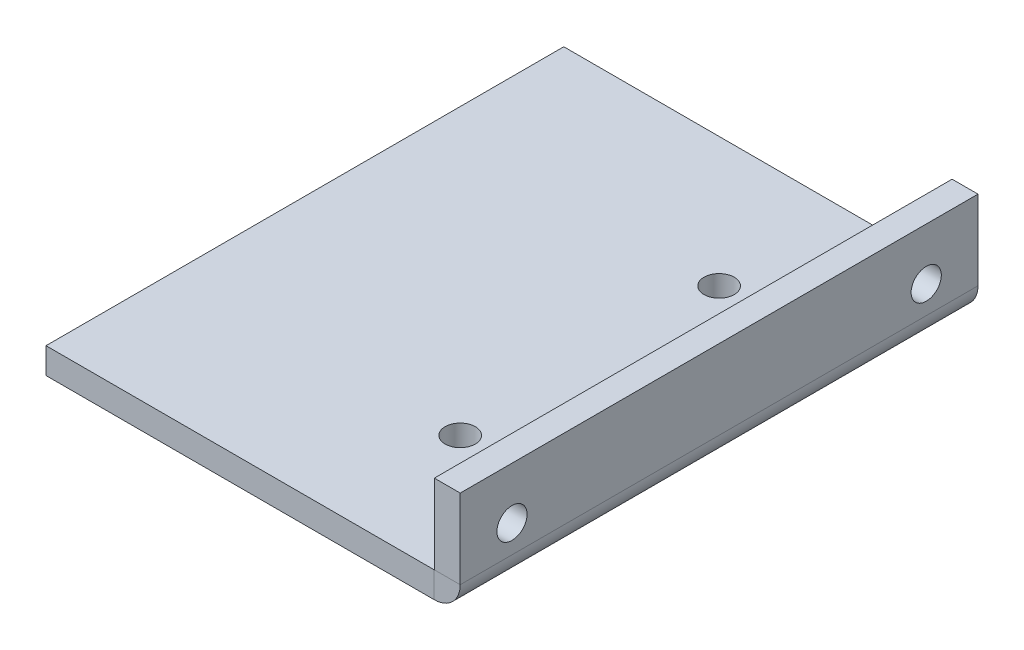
ISO-10303-21;
HEADER;
FILE_DESCRIPTION(('STEP AP214'),'2;1');
FILE_NAME('part.step','',(''),(''),'','','');
FILE_SCHEMA(('AUTOMOTIVE_DESIGN { 1 0 10303 214 1 1 1 1 }'));
ENDSEC;
DATA;
#1=APPLICATION_CONTEXT('core data for automotive mechanical design processes');
#2=APPLICATION_PROTOCOL_DEFINITION('international standard','automotive_design',2000,#1);
#3=PRODUCT_CONTEXT('',#1,'mechanical');
#4=PRODUCT('Part','Part','',(#3));
#5=PRODUCT_RELATED_PRODUCT_CATEGORY('part','',(#4));
#6=PRODUCT_DEFINITION_FORMATION('','',#4);
#7=PRODUCT_DEFINITION_CONTEXT('part definition',#1,'design');
#8=PRODUCT_DEFINITION('design','',#6,#7);
#9=PRODUCT_DEFINITION_SHAPE('','',#8);
#10=(LENGTH_UNIT() NAMED_UNIT(*) SI_UNIT(.MILLI.,.METRE.));
#11=(NAMED_UNIT(*) PLANE_ANGLE_UNIT() SI_UNIT($,.RADIAN.));
#12=(NAMED_UNIT(*) SI_UNIT($,.STERADIAN.) SOLID_ANGLE_UNIT());
#13=UNCERTAINTY_MEASURE_WITH_UNIT(LENGTH_MEASURE(1.E-05),#10,'distance_accuracy_value','');
#14=(GEOMETRIC_REPRESENTATION_CONTEXT(3) GLOBAL_UNCERTAINTY_ASSIGNED_CONTEXT((#13)) GLOBAL_UNIT_ASSIGNED_CONTEXT((#10,
#11,#12)) REPRESENTATION_CONTEXT('',''));
#15=CARTESIAN_POINT('',(0.,0.,0.));
#16=DIRECTION('',(0.,0.,1.));
#17=DIRECTION('',(1.,0.,0.));
#18=AXIS2_PLACEMENT_3D('',#15,#16,#17);
#19=CARTESIAN_POINT('',(45.0000000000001,-44.7901546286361,-60.));
#20=DIRECTION('',(1.,0.,0.));
#21=DIRECTION('',(0.,0.,-1.));
#22=AXIS2_PLACEMENT_3D('',#19,#20,#21);
#23=PLANE('',#22);
#24=CARTESIAN_POINT('',(45.,6.20984537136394,-54.));
#25=DIRECTION('',(-1.,0.,0.));
#26=DIRECTION('',(0.,0.,1.));
#27=AXIS2_PLACEMENT_3D('',#24,#25,#26);
#28=CIRCLE('',#27,1.75);
#29=CARTESIAN_POINT('',(45.,6.20984537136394,-52.25));
#30=VERTEX_POINT('',#29);
#31=EDGE_CURVE('E147',#30,#30,#28,.T.);
#32=ORIENTED_EDGE('',*,*,#31,.F.);
#33=EDGE_LOOP('',(#32));
#34=FACE_BOUND('',#33,.T.);
#35=CARTESIAN_POINT('',(45.,6.20984537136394,-6.));
#36=DIRECTION('',(-1.,0.,0.));
#37=DIRECTION('',(0.,0.,1.));
#38=AXIS2_PLACEMENT_3D('',#35,#36,#37);
#39=CIRCLE('',#38,1.75);
#40=CARTESIAN_POINT('',(45.,6.20984537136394,-4.25));
#41=VERTEX_POINT('',#40);
#42=EDGE_CURVE('E412',#41,#41,#39,.T.);
#43=ORIENTED_EDGE('',*,*,#42,.F.);
#44=EDGE_LOOP('',(#43));
#45=FACE_BOUND('',#44,.T.);
#46=DIRECTION('',(0.,-1.,0.));
#47=VECTOR('',#46,1.);
#48=CARTESIAN_POINT('',(45.0000000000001,-44.7901546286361,-60.));
#49=LINE('',#48,#47);
#50=CARTESIAN_POINT('',(45.,12.2098453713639,-60.));
#51=VERTEX_POINT('',#50);
#52=CARTESIAN_POINT('',(45.0000000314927,3.01,-60.));
#53=VERTEX_POINT('',#52);
#54=EDGE_CURVE('E42',#51,#53,#49,.T.);
#55=ORIENTED_EDGE('',*,*,#54,.T.);
#56=DIRECTION('',(0.,0.,1.));
#57=VECTOR('',#56,1.);
#58=CARTESIAN_POINT('',(45.,3.01000000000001,-60.));
#59=LINE('',#58,#57);
#60=CARTESIAN_POINT('',(45.,3.01,0.));
#61=VERTEX_POINT('',#60);
#62=EDGE_CURVE('E118',#53,#61,#59,.T.);
#63=ORIENTED_EDGE('',*,*,#62,.T.);
#64=DIRECTION('',(0.,1.,0.));
#65=VECTOR('',#64,1.);
#66=CARTESIAN_POINT('',(45.0000000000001,-44.7901546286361,0.));
#67=LINE('',#66,#65);
#68=CARTESIAN_POINT('',(45.,12.2098453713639,0.));
#69=VERTEX_POINT('',#68);
#70=EDGE_CURVE('E137',#61,#69,#67,.T.);
#71=ORIENTED_EDGE('',*,*,#70,.T.);
#72=DIRECTION('',(0.,0.,-1.));
#73=VECTOR('',#72,1.);
#74=CARTESIAN_POINT('',(45.,12.2098453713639,0.));
#75=LINE('',#74,#73);
#76=EDGE_CURVE('E63',#69,#51,#75,.T.);
#77=ORIENTED_EDGE('',*,*,#76,.T.);
#78=EDGE_LOOP('',(#55,#63,#71,#77));
#79=FACE_BOUND('',#78,.T.);
#80=ADVANCED_FACE('F38',(#34,#45,#79),#23,.F.);
#81=CARTESIAN_POINT('',(45.0000000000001,-44.7901546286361,0.));
#82=DIRECTION('',(0.,0.,-1.));
#83=DIRECTION('',(0.,-1.,0.));
#84=AXIS2_PLACEMENT_3D('',#81,#82,#83);
#85=PLANE('',#84);
#86=ORIENTED_EDGE('',*,*,#70,.F.);
#87=DIRECTION('',(1.,0.,0.));
#88=VECTOR('',#87,1.);
#89=CARTESIAN_POINT('',(45.,3.01000000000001,0.));
#90=LINE('',#89,#88);
#91=CARTESIAN_POINT('',(48.0000000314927,3.01,0.));
#92=VERTEX_POINT('',#91);
#93=EDGE_CURVE('E12',#61,#92,#90,.T.);
#94=ORIENTED_EDGE('',*,*,#93,.T.);
#95=DIRECTION('',(0.,1.,0.));
#96=VECTOR('',#95,1.);
#97=CARTESIAN_POINT('',(48.0000000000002,-44.790154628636,0.));
#98=LINE('',#97,#96);
#99=CARTESIAN_POINT('',(48.,12.209845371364,0.));
#100=VERTEX_POINT('',#99);
#101=EDGE_CURVE('E143',#92,#100,#98,.T.);
#102=ORIENTED_EDGE('',*,*,#101,.T.);
#103=DIRECTION('',(1.,0.,0.));
#104=VECTOR('',#103,1.);
#105=CARTESIAN_POINT('',(45.,12.2098453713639,0.));
#106=LINE('',#105,#104);
#107=EDGE_CURVE('E156',#69,#100,#106,.T.);
#108=ORIENTED_EDGE('',*,*,#107,.F.);
#109=EDGE_LOOP('',(#86,#94,#102,#108));
#110=FACE_BOUND('',#109,.T.);
#111=ADVANCED_FACE('F40',(#110),#85,.F.);
#112=CARTESIAN_POINT('',(45.0000000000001,-44.7901546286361,-60.));
#113=DIRECTION('',(0.,0.,1.));
#114=DIRECTION('',(0.,1.,0.));
#115=AXIS2_PLACEMENT_3D('',#112,#113,#114);
#116=PLANE('',#115);
#117=DIRECTION('',(0.,-1.,0.));
#118=VECTOR('',#117,1.);
#119=CARTESIAN_POINT('',(48.0000000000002,-44.790154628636,-60.));
#120=LINE('',#119,#118);
#121=CARTESIAN_POINT('',(48.,12.209845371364,-60.));
#122=VERTEX_POINT('',#121);
#123=CARTESIAN_POINT('',(48.0000000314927,3.01,-60.));
#124=VERTEX_POINT('',#123);
#125=EDGE_CURVE('E132',#122,#124,#120,.T.);
#126=ORIENTED_EDGE('',*,*,#125,.T.);
#127=DIRECTION('',(-1.,0.,0.));
#128=VECTOR('',#127,1.);
#129=CARTESIAN_POINT('',(45.,3.01000000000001,-60.));
#130=LINE('',#129,#128);
#131=EDGE_CURVE('E108',#124,#53,#130,.T.);
#132=ORIENTED_EDGE('',*,*,#131,.T.);
#133=ORIENTED_EDGE('',*,*,#54,.F.);
#134=DIRECTION('',(1.,0.,0.));
#135=VECTOR('',#134,1.);
#136=CARTESIAN_POINT('',(45.,12.2098453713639,-60.));
#137=LINE('',#136,#135);
#138=EDGE_CURVE('E134',#51,#122,#137,.T.);
#139=ORIENTED_EDGE('',*,*,#138,.T.);
#140=EDGE_LOOP('',(#126,#132,#133,#139));
#141=FACE_BOUND('',#140,.T.);
#142=ADVANCED_FACE('F133',(#141),#116,.F.);
#143=CARTESIAN_POINT('',(48.0000000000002,-44.790154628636,-60.));
#144=DIRECTION('',(1.,0.,0.));
#145=DIRECTION('',(0.,0.,-1.));
#146=AXIS2_PLACEMENT_3D('',#143,#144,#145);
#147=PLANE('',#146);
#148=DIRECTION('',(0.,0.,1.));
#149=VECTOR('',#148,1.);
#150=CARTESIAN_POINT('',(48.,3.01000000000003,-60.));
#151=LINE('',#150,#149);
#152=EDGE_CURVE('E47',#124,#92,#151,.T.);
#153=ORIENTED_EDGE('',*,*,#152,.F.);
#154=ORIENTED_EDGE('',*,*,#125,.F.);
#155=DIRECTION('',(0.,0.,-1.));
#156=VECTOR('',#155,1.);
#157=CARTESIAN_POINT('',(48.,12.209845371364,0.));
#158=LINE('',#157,#156);
#159=EDGE_CURVE('E138',#100,#122,#158,.T.);
#160=ORIENTED_EDGE('',*,*,#159,.F.);
#161=ORIENTED_EDGE('',*,*,#101,.F.);
#162=EDGE_LOOP('',(#153,#154,#160,#161));
#163=FACE_BOUND('',#162,.T.);
#164=CARTESIAN_POINT('',(48.,6.20984537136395,-54.));
#165=DIRECTION('',(-1.,0.,0.));
#166=DIRECTION('',(0.,0.,1.));
#167=AXIS2_PLACEMENT_3D('',#164,#165,#166);
#168=CIRCLE('',#167,1.75);
#169=CARTESIAN_POINT('',(48.,6.20984537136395,-52.25));
#170=VERTEX_POINT('',#169);
#171=EDGE_CURVE('E415',#170,#170,#168,.T.);
#172=ORIENTED_EDGE('',*,*,#171,.T.);
#173=EDGE_LOOP('',(#172));
#174=FACE_BOUND('',#173,.T.);
#175=CARTESIAN_POINT('',(48.,6.20984537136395,-6.));
#176=DIRECTION('',(-1.,0.,0.));
#177=DIRECTION('',(0.,0.,1.));
#178=AXIS2_PLACEMENT_3D('',#175,#176,#177);
#179=CIRCLE('',#178,1.75);
#180=CARTESIAN_POINT('',(48.,6.20984537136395,-4.25));
#181=VERTEX_POINT('',#180);
#182=EDGE_CURVE('E375',#181,#181,#179,.T.);
#183=ORIENTED_EDGE('',*,*,#182,.T.);
#184=EDGE_LOOP('',(#183));
#185=FACE_BOUND('',#184,.T.);
#186=ADVANCED_FACE('F141',(#163,#174,#185),#147,.T.);
#187=CARTESIAN_POINT('',(45.,12.2098453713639,0.));
#188=DIRECTION('',(0.,-1.,0.));
#189=DIRECTION('',(0.,0.,1.));
#190=AXIS2_PLACEMENT_3D('',#187,#188,#189);
#191=PLANE('',#190);
#192=ORIENTED_EDGE('',*,*,#159,.T.);
#193=ORIENTED_EDGE('',*,*,#138,.F.);
#194=ORIENTED_EDGE('',*,*,#76,.F.);
#195=ORIENTED_EDGE('',*,*,#107,.T.);
#196=EDGE_LOOP('',(#192,#193,#194,#195));
#197=FACE_BOUND('',#196,.T.);
#198=ADVANCED_FACE('F160',(#197),#191,.F.);
#199=CARTESIAN_POINT('',(45.,6.20984537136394,-54.));
#200=DIRECTION('',(1.,0.,0.));
#201=DIRECTION('',(0.,0.,-1.));
#202=AXIS2_PLACEMENT_3D('',#199,#200,#201);
#203=CYLINDRICAL_SURFACE('',#202,1.75);
#204=ORIENTED_EDGE('',*,*,#31,.T.);
#205=EDGE_LOOP('',(#204));
#206=FACE_BOUND('',#205,.T.);
#207=ORIENTED_EDGE('',*,*,#171,.F.);
#208=EDGE_LOOP('',(#207));
#209=FACE_BOUND('',#208,.T.);
#210=ADVANCED_FACE('F162',(#206,#209),#203,.F.);
#211=CARTESIAN_POINT('',(45.,6.20984537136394,-6.));
#212=DIRECTION('',(1.,0.,0.));
#213=DIRECTION('',(0.,0.,-1.));
#214=AXIS2_PLACEMENT_3D('',#211,#212,#213);
#215=CYLINDRICAL_SURFACE('',#214,1.75);
#216=ORIENTED_EDGE('',*,*,#42,.T.);
#217=EDGE_LOOP('',(#216));
#218=FACE_BOUND('',#217,.T.);
#219=ORIENTED_EDGE('',*,*,#182,.F.);
#220=EDGE_LOOP('',(#219));
#221=FACE_BOUND('',#220,.T.);
#222=ADVANCED_FACE('F168',(#218,#221),#215,.F.);
#223=CARTESIAN_POINT('',(33.,3.,-15.));
#224=DIRECTION('',(0.,-1.,0.));
#225=DIRECTION('',(0.,0.,-1.));
#226=AXIS2_PLACEMENT_3D('',#223,#224,#225);
#227=CYLINDRICAL_SURFACE('',#226,1.75);
#228=CARTESIAN_POINT('',(33.,3.,-15.));
#229=DIRECTION('',(0.,1.,0.));
#230=DIRECTION('',(0.,0.,1.));
#231=AXIS2_PLACEMENT_3D('',#228,#229,#230);
#232=CIRCLE('',#231,1.75);
#233=CARTESIAN_POINT('',(33.,3.,-13.25));
#234=VERTEX_POINT('',#233);
#235=EDGE_CURVE('E404',#234,#234,#232,.T.);
#236=ORIENTED_EDGE('',*,*,#235,.T.);
#237=EDGE_LOOP('',(#236));
#238=FACE_BOUND('',#237,.T.);
#239=CARTESIAN_POINT('',(33.,0.,-15.));
#240=DIRECTION('',(0.,1.,0.));
#241=DIRECTION('',(0.,0.,1.));
#242=AXIS2_PLACEMENT_3D('',#239,#240,#241);
#243=CIRCLE('',#242,1.75);
#244=CARTESIAN_POINT('',(33.,0.,-13.25));
#245=VERTEX_POINT('',#244);
#246=EDGE_CURVE('E383',#245,#245,#243,.T.);
#247=ORIENTED_EDGE('',*,*,#246,.F.);
#248=EDGE_LOOP('',(#247));
#249=FACE_BOUND('',#248,.T.);
#250=ADVANCED_FACE('F213',(#238,#249),#227,.F.);
#251=CARTESIAN_POINT('',(33.,3.,-45.));
#252=DIRECTION('',(0.,-1.,0.));
#253=DIRECTION('',(0.,0.,-1.));
#254=AXIS2_PLACEMENT_3D('',#251,#252,#253);
#255=CYLINDRICAL_SURFACE('',#254,1.75);
#256=CARTESIAN_POINT('',(33.,3.,-45.));
#257=DIRECTION('',(0.,1.,0.));
#258=DIRECTION('',(0.,0.,1.));
#259=AXIS2_PLACEMENT_3D('',#256,#257,#258);
#260=CIRCLE('',#259,1.75);
#261=CARTESIAN_POINT('',(33.,3.,-43.25));
#262=VERTEX_POINT('',#261);
#263=EDGE_CURVE('E401',#262,#262,#260,.T.);
#264=ORIENTED_EDGE('',*,*,#263,.T.);
#265=EDGE_LOOP('',(#264));
#266=FACE_BOUND('',#265,.T.);
#267=CARTESIAN_POINT('',(33.,0.,-45.));
#268=DIRECTION('',(0.,1.,0.));
#269=DIRECTION('',(0.,0.,1.));
#270=AXIS2_PLACEMENT_3D('',#267,#268,#269);
#271=CIRCLE('',#270,1.75);
#272=CARTESIAN_POINT('',(33.,0.,-43.25));
#273=VERTEX_POINT('',#272);
#274=EDGE_CURVE('E380',#273,#273,#271,.T.);
#275=ORIENTED_EDGE('',*,*,#274,.F.);
#276=EDGE_LOOP('',(#275));
#277=FACE_BOUND('',#276,.T.);
#278=ADVANCED_FACE('F224',(#266,#277),#255,.F.);
#279=CARTESIAN_POINT('',(0.,3.,0.));
#280=DIRECTION('',(1.,0.,0.));
#281=DIRECTION('',(0.,0.,-1.));
#282=AXIS2_PLACEMENT_3D('',#279,#280,#281);
#283=PLANE('',#282);
#284=DIRECTION('',(0.,0.,1.));
#285=VECTOR('',#284,1.);
#286=CARTESIAN_POINT('',(0.,0.,0.));
#287=LINE('',#286,#285);
#288=CARTESIAN_POINT('',(0.,0.,-60.));
#289=VERTEX_POINT('',#288);
#290=CARTESIAN_POINT('',(0.,0.,0.));
#291=VERTEX_POINT('',#290);
#292=EDGE_CURVE('E398',#289,#291,#287,.T.);
#293=ORIENTED_EDGE('',*,*,#292,.T.);
#294=DIRECTION('',(0.,-1.,0.));
#295=VECTOR('',#294,1.);
#296=CARTESIAN_POINT('',(0.,3.,0.));
#297=LINE('',#296,#295);
#298=CARTESIAN_POINT('',(0.,3.,0.));
#299=VERTEX_POINT('',#298);
#300=EDGE_CURVE('E376',#299,#291,#297,.T.);
#301=ORIENTED_EDGE('',*,*,#300,.F.);
#302=DIRECTION('',(0.,0.,1.));
#303=VECTOR('',#302,1.);
#304=CARTESIAN_POINT('',(0.,3.,0.));
#305=LINE('',#304,#303);
#306=CARTESIAN_POINT('',(0.,3.,-60.));
#307=VERTEX_POINT('',#306);
#308=EDGE_CURVE('E390',#307,#299,#305,.T.);
#309=ORIENTED_EDGE('',*,*,#308,.F.);
#310=DIRECTION('',(0.,-1.,0.));
#311=VECTOR('',#310,1.);
#312=CARTESIAN_POINT('',(0.,3.,-60.));
#313=LINE('',#312,#311);
#314=EDGE_CURVE('E395',#307,#289,#313,.T.);
#315=ORIENTED_EDGE('',*,*,#314,.T.);
#316=EDGE_LOOP('',(#293,#301,#309,#315));
#317=FACE_BOUND('',#316,.T.);
#318=ADVANCED_FACE('F236',(#317),#283,.F.);
#319=CARTESIAN_POINT('',(0.,3.,-60.));
#320=DIRECTION('',(0.,-1.,0.));
#321=DIRECTION('',(0.,0.,-1.));
#322=AXIS2_PLACEMENT_3D('',#319,#320,#321);
#323=PLANE('',#322);
#324=DIRECTION('',(0.,0.,1.));
#325=VECTOR('',#324,1.);
#326=CARTESIAN_POINT('',(44.99,3.,-60.));
#327=LINE('',#326,#325);
#328=CARTESIAN_POINT('',(44.99,2.99999998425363,-60.));
#329=VERTEX_POINT('',#328);
#330=CARTESIAN_POINT('',(44.99,3.,0.));
#331=VERTEX_POINT('',#330);
#332=EDGE_CURVE('E364',#329,#331,#327,.T.);
#333=ORIENTED_EDGE('',*,*,#332,.F.);
#334=DIRECTION('',(-1.,0.,0.));
#335=VECTOR('',#334,1.);
#336=CARTESIAN_POINT('',(0.,3.,-60.));
#337=LINE('',#336,#335);
#338=EDGE_CURVE('E393',#329,#307,#337,.T.);
#339=ORIENTED_EDGE('',*,*,#338,.T.);
#340=ORIENTED_EDGE('',*,*,#308,.T.);
#341=DIRECTION('',(1.,0.,0.));
#342=VECTOR('',#341,1.);
#343=CARTESIAN_POINT('',(0.,3.,0.));
#344=LINE('',#343,#342);
#345=EDGE_CURVE('E388',#299,#331,#344,.T.);
#346=ORIENTED_EDGE('',*,*,#345,.T.);
#347=EDGE_LOOP('',(#333,#339,#340,#346));
#348=FACE_BOUND('',#347,.T.);
#349=ORIENTED_EDGE('',*,*,#263,.F.);
#350=EDGE_LOOP('',(#349));
#351=FACE_BOUND('',#350,.T.);
#352=ORIENTED_EDGE('',*,*,#235,.F.);
#353=EDGE_LOOP('',(#352));
#354=FACE_BOUND('',#353,.T.);
#355=ADVANCED_FACE('F247',(#348,#351,#354),#323,.F.);
#356=CARTESIAN_POINT('',(0.,3.,-60.));
#357=DIRECTION('',(0.,0.,1.));
#358=DIRECTION('',(1.,0.,0.));
#359=AXIS2_PLACEMENT_3D('',#356,#357,#358);
#360=PLANE('',#359);
#361=DIRECTION('',(0.,1.,0.));
#362=VECTOR('',#361,1.);
#363=CARTESIAN_POINT('',(44.99,3.,-60.));
#364=LINE('',#363,#362);
#365=CARTESIAN_POINT('',(44.99,0.,-60.));
#366=VERTEX_POINT('',#365);
#367=EDGE_CURVE('E407',#366,#329,#364,.T.);
#368=ORIENTED_EDGE('',*,*,#367,.F.);
#369=DIRECTION('',(-1.,0.,0.));
#370=VECTOR('',#369,1.);
#371=CARTESIAN_POINT('',(0.,0.,-60.));
#372=LINE('',#371,#370);
#373=EDGE_CURVE('E386',#366,#289,#372,.T.);
#374=ORIENTED_EDGE('',*,*,#373,.T.);
#375=ORIENTED_EDGE('',*,*,#314,.F.);
#376=ORIENTED_EDGE('',*,*,#338,.F.);
#377=EDGE_LOOP('',(#368,#374,#375,#376));
#378=FACE_BOUND('',#377,.T.);
#379=ADVANCED_FACE('F258',(#378),#360,.F.);
#380=CARTESIAN_POINT('',(0.,0.,-60.));
#381=DIRECTION('',(0.,-1.,0.));
#382=DIRECTION('',(0.,0.,-1.));
#383=AXIS2_PLACEMENT_3D('',#380,#381,#382);
#384=PLANE('',#383);
#385=ORIENTED_EDGE('',*,*,#246,.T.);
#386=EDGE_LOOP('',(#385));
#387=FACE_BOUND('',#386,.T.);
#388=ORIENTED_EDGE('',*,*,#274,.T.);
#389=EDGE_LOOP('',(#388));
#390=FACE_BOUND('',#389,.T.);
#391=ORIENTED_EDGE('',*,*,#373,.F.);
#392=DIRECTION('',(0.,0.,1.));
#393=VECTOR('',#392,1.);
#394=CARTESIAN_POINT('',(44.99,0.,-60.));
#395=LINE('',#394,#393);
#396=CARTESIAN_POINT('',(44.99,0.,0.));
#397=VERTEX_POINT('',#396);
#398=EDGE_CURVE('E127',#366,#397,#395,.T.);
#399=ORIENTED_EDGE('',*,*,#398,.T.);
#400=DIRECTION('',(1.,0.,0.));
#401=VECTOR('',#400,1.);
#402=CARTESIAN_POINT('',(0.,0.,0.));
#403=LINE('',#402,#401);
#404=EDGE_CURVE('E373',#291,#397,#403,.T.);
#405=ORIENTED_EDGE('',*,*,#404,.F.);
#406=ORIENTED_EDGE('',*,*,#292,.F.);
#407=EDGE_LOOP('',(#391,#399,#405,#406));
#408=FACE_BOUND('',#407,.T.);
#409=ADVANCED_FACE('F269',(#387,#390,#408),#384,.T.);
#410=CARTESIAN_POINT('',(0.,3.,0.));
#411=DIRECTION('',(0.,0.,-1.));
#412=DIRECTION('',(-1.,0.,0.));
#413=AXIS2_PLACEMENT_3D('',#410,#411,#412);
#414=PLANE('',#413);
#415=DIRECTION('',(0.,-1.,0.));
#416=VECTOR('',#415,1.);
#417=CARTESIAN_POINT('',(44.99,3.,0.));
#418=LINE('',#417,#416);
#419=EDGE_CURVE('E365',#331,#397,#418,.T.);
#420=ORIENTED_EDGE('',*,*,#419,.F.);
#421=ORIENTED_EDGE('',*,*,#345,.F.);
#422=ORIENTED_EDGE('',*,*,#300,.T.);
#423=ORIENTED_EDGE('',*,*,#404,.T.);
#424=EDGE_LOOP('',(#420,#421,#422,#423));
#425=FACE_BOUND('',#424,.T.);
#426=ADVANCED_FACE('F280',(#425),#414,.F.);
#427=CARTESIAN_POINT('',(44.99,3.01000003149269,-60.));
#428=DIRECTION('',(0.,0.,1.));
#429=DIRECTION('',(1.,0.,0.));
#430=AXIS2_PLACEMENT_3D('',#427,#428,#429);
#431=PLANE('',#430);
#432=ORIENTED_EDGE('',*,*,#131,.F.);
#433=CARTESIAN_POINT('',(44.99,3.01,-60.));
#434=DIRECTION('',(0.,0.,-1.));
#435=DIRECTION('',(-1.,0.,0.));
#436=AXIS2_PLACEMENT_3D('',#433,#434,#435);
#437=CIRCLE('',#436,3.01000003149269);
#438=EDGE_CURVE('E112',#124,#366,#437,.T.);
#439=ORIENTED_EDGE('',*,*,#438,.T.);
#440=ORIENTED_EDGE('',*,*,#367,.T.);
#441=CARTESIAN_POINT('',(44.99,3.01000003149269,-60.));
#442=DIRECTION('',(0.,0.,-1.));
#443=DIRECTION('',(-1.,0.,0.));
#444=AXIS2_PLACEMENT_3D('',#441,#442,#443);
#445=CIRCLE('',#444,0.0100000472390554);
#446=EDGE_CURVE('E114',#53,#329,#445,.T.);
#447=ORIENTED_EDGE('',*,*,#446,.F.);
#448=EDGE_LOOP('',(#432,#439,#440,#447));
#449=FACE_BOUND('',#448,.T.);
#450=ADVANCED_FACE('F110',(#449),#431,.F.);
#451=CARTESIAN_POINT('',(44.99,3.01000003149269,0.));
#452=DIRECTION('',(0.,0.,-1.));
#453=DIRECTION('',(-1.,0.,0.));
#454=AXIS2_PLACEMENT_3D('',#451,#452,#453);
#455=PLANE('',#454);
#456=CARTESIAN_POINT('',(44.99,3.01,0.));
#457=DIRECTION('',(0.,0.,-1.));
#458=DIRECTION('',(-1.,0.,0.));
#459=AXIS2_PLACEMENT_3D('',#456,#457,#458);
#460=CIRCLE('',#459,3.01000003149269);
#461=EDGE_CURVE('E128',#397,#92,#460,.F.);
#462=ORIENTED_EDGE('',*,*,#461,.T.);
#463=ORIENTED_EDGE('',*,*,#93,.F.);
#464=CARTESIAN_POINT('',(44.99,3.01000003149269,0.));
#465=DIRECTION('',(0.,0.,1.));
#466=DIRECTION('',(1.,0.,0.));
#467=AXIS2_PLACEMENT_3D('',#464,#465,#466);
#468=CIRCLE('',#467,0.0100000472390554);
#469=EDGE_CURVE('E55',#331,#61,#468,.T.);
#470=ORIENTED_EDGE('',*,*,#469,.F.);
#471=ORIENTED_EDGE('',*,*,#419,.T.);
#472=EDGE_LOOP('',(#462,#463,#470,#471));
#473=FACE_BOUND('',#472,.T.);
#474=ADVANCED_FACE('F300',(#473),#455,.F.);
#475=CARTESIAN_POINT('',(44.99,3.01,30.1406432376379));
#476=DIRECTION('',(0.,0.,-1.));
#477=DIRECTION('',(-1.,0.,0.));
#478=AXIS2_PLACEMENT_3D('',#475,#476,#477);
#479=CYLINDRICAL_SURFACE('',#478,0.0100000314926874);
#480=ORIENTED_EDGE('',*,*,#332,.T.);
#481=ORIENTED_EDGE('',*,*,#469,.T.);
#482=ORIENTED_EDGE('',*,*,#62,.F.);
#483=ORIENTED_EDGE('',*,*,#446,.T.);
#484=EDGE_LOOP('',(#480,#481,#482,#483));
#485=FACE_BOUND('',#484,.T.);
#486=ADVANCED_FACE('F302',(#485),#479,.F.);
#487=CARTESIAN_POINT('',(44.99,3.01,30.1406432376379));
#488=DIRECTION('',(0.,0.,-1.));
#489=DIRECTION('',(-1.,0.,0.));
#490=AXIS2_PLACEMENT_3D('',#487,#488,#489);
#491=CYLINDRICAL_SURFACE('',#490,3.01000003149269);
#492=ORIENTED_EDGE('',*,*,#398,.F.);
#493=ORIENTED_EDGE('',*,*,#438,.F.);
#494=ORIENTED_EDGE('',*,*,#152,.T.);
#495=ORIENTED_EDGE('',*,*,#461,.F.);
#496=EDGE_LOOP('',(#492,#493,#494,#495));
#497=FACE_BOUND('',#496,.T.);
#498=ADVANCED_FACE('F122',(#497),#491,.T.);
#499=CLOSED_SHELL('',(#80,#111,#142,#186,#198,#210,#222,#250,#278,#318,#355,#379,#409,#426,#450,
#474,#486,#498));
#500=MANIFOLD_SOLID_BREP('B2',#499);
#501=ADVANCED_BREP_SHAPE_REPRESENTATION('',(#18,#500),#14);
#502=SHAPE_DEFINITION_REPRESENTATION(#9,#501);
ENDSEC;
END-ISO-10303-21;
